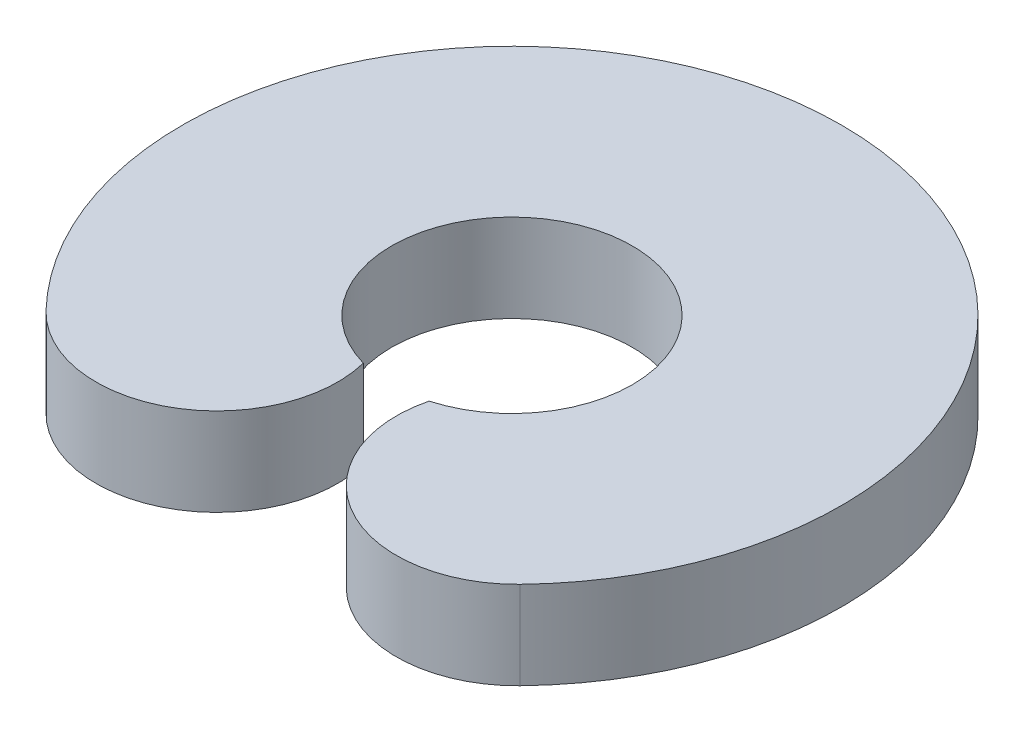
ISO-10303-21;
HEADER;
FILE_DESCRIPTION(('STEP AP214'),'2;1');
FILE_NAME('part.step','',(''),(''),'','','');
FILE_SCHEMA(('AUTOMOTIVE_DESIGN { 1 0 10303 214 1 1 1 1 }'));
ENDSEC;
DATA;
#1=APPLICATION_CONTEXT('core data for automotive mechanical design processes');
#2=APPLICATION_PROTOCOL_DEFINITION('international standard','automotive_design',2000,#1);
#3=PRODUCT_CONTEXT('',#1,'mechanical');
#4=PRODUCT('Part','Part','',(#3));
#5=PRODUCT_RELATED_PRODUCT_CATEGORY('part','',(#4));
#6=PRODUCT_DEFINITION_FORMATION('','',#4);
#7=PRODUCT_DEFINITION_CONTEXT('part definition',#1,'design');
#8=PRODUCT_DEFINITION('design','',#6,#7);
#9=PRODUCT_DEFINITION_SHAPE('','',#8);
#10=(LENGTH_UNIT() NAMED_UNIT(*) SI_UNIT(.MILLI.,.METRE.));
#11=(NAMED_UNIT(*) PLANE_ANGLE_UNIT() SI_UNIT($,.RADIAN.));
#12=(NAMED_UNIT(*) SI_UNIT($,.STERADIAN.) SOLID_ANGLE_UNIT());
#13=UNCERTAINTY_MEASURE_WITH_UNIT(LENGTH_MEASURE(1.E-05),#10,'distance_accuracy_value','');
#14=(GEOMETRIC_REPRESENTATION_CONTEXT(3) GLOBAL_UNCERTAINTY_ASSIGNED_CONTEXT((#13)) GLOBAL_UNIT_ASSIGNED_CONTEXT((#10,
#11,#12)) REPRESENTATION_CONTEXT('',''));
#15=CARTESIAN_POINT('',(0.,0.,0.));
#16=DIRECTION('',(0.,0.,1.));
#17=DIRECTION('',(1.,0.,0.));
#18=AXIS2_PLACEMENT_3D('',#15,#16,#17);
#19=CARTESIAN_POINT('',(-341.686405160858,200.,329.962725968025));
#20=DIRECTION('',(0.,-1.,0.));
#21=DIRECTION('',(0.,0.,-1.));
#22=AXIS2_PLACEMENT_3D('',#19,#20,#21);
#23=CYLINDRICAL_SURFACE('',#22,275.);
#24=CARTESIAN_POINT('',(-341.686405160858,0.,329.962725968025));
#25=DIRECTION('',(0.,1.,0.));
#26=DIRECTION('',(0.,0.,1.));
#27=AXIS2_PLACEMENT_3D('',#24,#25,#26);
#28=CIRCLE('',#27,275.);
#29=CARTESIAN_POINT('',(-539.504850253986,0.,520.993777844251));
#30=VERTEX_POINT('',#29);
#31=CARTESIAN_POINT('',(-74.8550804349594,0.,263.434204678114));
#32=VERTEX_POINT('',#31);
#33=EDGE_CURVE('E95',#30,#32,#28,.T.);
#34=ORIENTED_EDGE('',*,*,#33,.T.);
#35=DIRECTION('',(0.,-1.,0.));
#36=VECTOR('',#35,1.);
#37=CARTESIAN_POINT('',(-74.8550804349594,200.,263.434204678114));
#38=LINE('',#37,#36);
#39=CARTESIAN_POINT('',(-74.8550804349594,200.,263.434204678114));
#40=VERTEX_POINT('',#39);
#41=EDGE_CURVE('E11',#40,#32,#38,.T.);
#42=ORIENTED_EDGE('',*,*,#41,.F.);
#43=CARTESIAN_POINT('',(-341.686405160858,200.,329.962725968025));
#44=DIRECTION('',(0.,1.,0.));
#45=DIRECTION('',(0.,0.,1.));
#46=AXIS2_PLACEMENT_3D('',#43,#44,#45);
#47=CIRCLE('',#46,275.);
#48=CARTESIAN_POINT('',(-539.504850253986,200.,520.993777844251));
#49=VERTEX_POINT('',#48);
#50=EDGE_CURVE('E83',#49,#40,#47,.T.);
#51=ORIENTED_EDGE('',*,*,#50,.F.);
#52=DIRECTION('',(0.,-1.,0.));
#53=VECTOR('',#52,1.);
#54=CARTESIAN_POINT('',(-539.504850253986,200.,520.993777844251));
#55=LINE('',#54,#53);
#56=EDGE_CURVE('E91',#49,#30,#55,.T.);
#57=ORIENTED_EDGE('',*,*,#56,.T.);
#58=EDGE_LOOP('',(#34,#42,#51,#57));
#59=FACE_BOUND('',#58,.T.);
#60=ADVANCED_FACE('F32',(#59),#23,.T.);
#61=CARTESIAN_POINT('',(0.,200.,0.));
#62=DIRECTION('',(0.,-1.,0.));
#63=DIRECTION('',(0.,0.,-1.));
#64=AXIS2_PLACEMENT_3D('',#61,#62,#63);
#65=CYLINDRICAL_SURFACE('',#64,273.862854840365);
#66=CARTESIAN_POINT('',(0.,0.,0.));
#67=DIRECTION('',(0.,-1.,0.));
#68=DIRECTION('',(0.,0.,1.));
#69=AXIS2_PLACEMENT_3D('',#66,#67,#68);
#70=CIRCLE('',#69,273.862854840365);
#71=CARTESIAN_POINT('',(74.8550804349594,0.,263.434204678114));
#72=VERTEX_POINT('',#71);
#73=EDGE_CURVE('E87',#32,#72,#70,.T.);
#74=ORIENTED_EDGE('',*,*,#73,.T.);
#75=DIRECTION('',(0.,-1.,0.));
#76=VECTOR('',#75,1.);
#77=CARTESIAN_POINT('',(74.8550804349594,200.,263.434204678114));
#78=LINE('',#77,#76);
#79=CARTESIAN_POINT('',(74.8550804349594,200.,263.434204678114));
#80=VERTEX_POINT('',#79);
#81=EDGE_CURVE('E40',#80,#72,#78,.T.);
#82=ORIENTED_EDGE('',*,*,#81,.F.);
#83=CARTESIAN_POINT('',(0.,200.,0.));
#84=DIRECTION('',(0.,-1.,0.));
#85=DIRECTION('',(0.,0.,1.));
#86=AXIS2_PLACEMENT_3D('',#83,#84,#85);
#87=CIRCLE('',#86,273.862854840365);
#88=EDGE_CURVE('E78',#40,#80,#87,.T.);
#89=ORIENTED_EDGE('',*,*,#88,.F.);
#90=ORIENTED_EDGE('',*,*,#41,.T.);
#91=EDGE_LOOP('',(#74,#82,#89,#90));
#92=FACE_BOUND('',#91,.T.);
#93=ADVANCED_FACE('F86',(#92),#65,.F.);
#94=CARTESIAN_POINT('',(341.686405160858,200.,329.962725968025));
#95=DIRECTION('',(0.,-1.,0.));
#96=DIRECTION('',(0.,0.,-1.));
#97=AXIS2_PLACEMENT_3D('',#94,#95,#96);
#98=CYLINDRICAL_SURFACE('',#97,275.);
#99=CARTESIAN_POINT('',(341.686405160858,0.,329.962725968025));
#100=DIRECTION('',(0.,1.,0.));
#101=DIRECTION('',(0.,0.,1.));
#102=AXIS2_PLACEMENT_3D('',#99,#100,#101);
#103=CIRCLE('',#102,275.);
#104=CARTESIAN_POINT('',(539.504850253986,0.,520.993777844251));
#105=VERTEX_POINT('',#104);
#106=EDGE_CURVE('E65',#72,#105,#103,.T.);
#107=ORIENTED_EDGE('',*,*,#106,.T.);
#108=DIRECTION('',(0.,-1.,0.));
#109=VECTOR('',#108,1.);
#110=CARTESIAN_POINT('',(539.504850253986,200.,520.993777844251));
#111=LINE('',#110,#109);
#112=CARTESIAN_POINT('',(539.504850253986,200.,520.993777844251));
#113=VERTEX_POINT('',#112);
#114=EDGE_CURVE('E88',#113,#105,#111,.T.);
#115=ORIENTED_EDGE('',*,*,#114,.F.);
#116=CARTESIAN_POINT('',(341.686405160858,200.,329.962725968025));
#117=DIRECTION('',(0.,1.,0.));
#118=DIRECTION('',(0.,0.,1.));
#119=AXIS2_PLACEMENT_3D('',#116,#117,#118);
#120=CIRCLE('',#119,275.);
#121=EDGE_CURVE('E81',#80,#113,#120,.T.);
#122=ORIENTED_EDGE('',*,*,#121,.F.);
#123=ORIENTED_EDGE('',*,*,#81,.T.);
#124=EDGE_LOOP('',(#107,#115,#122,#123));
#125=FACE_BOUND('',#124,.T.);
#126=ADVANCED_FACE('F89',(#125),#98,.T.);
#127=CARTESIAN_POINT('',(0.,200.,0.));
#128=DIRECTION('',(0.,-1.,0.));
#129=DIRECTION('',(0.,0.,-1.));
#130=AXIS2_PLACEMENT_3D('',#127,#128,#129);
#131=CYLINDRICAL_SURFACE('',#130,750.);
#132=CARTESIAN_POINT('',(0.,0.,0.));
#133=DIRECTION('',(0.,1.,0.));
#134=DIRECTION('',(0.,0.,1.));
#135=AXIS2_PLACEMENT_3D('',#132,#133,#134);
#136=CIRCLE('',#135,750.);
#137=EDGE_CURVE('E71',#105,#30,#136,.T.);
#138=ORIENTED_EDGE('',*,*,#137,.T.);
#139=ORIENTED_EDGE('',*,*,#56,.F.);
#140=CARTESIAN_POINT('',(0.,200.,0.));
#141=DIRECTION('',(0.,1.,0.));
#142=DIRECTION('',(0.,0.,1.));
#143=AXIS2_PLACEMENT_3D('',#140,#141,#142);
#144=CIRCLE('',#143,750.);
#145=EDGE_CURVE('E48',#113,#49,#144,.T.);
#146=ORIENTED_EDGE('',*,*,#145,.F.);
#147=ORIENTED_EDGE('',*,*,#114,.T.);
#148=EDGE_LOOP('',(#138,#139,#146,#147));
#149=FACE_BOUND('',#148,.T.);
#150=ADVANCED_FACE('F102',(#149),#131,.T.);
#151=CARTESIAN_POINT('',(-170.843202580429,200.,164.981362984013));
#152=DIRECTION('',(0.,1.,0.));
#153=DIRECTION('',(0.,0.,1.));
#154=AXIS2_PLACEMENT_3D('',#151,#152,#153);
#155=PLANE('',#154);
#156=ORIENTED_EDGE('',*,*,#50,.T.);
#157=ORIENTED_EDGE('',*,*,#88,.T.);
#158=ORIENTED_EDGE('',*,*,#121,.T.);
#159=ORIENTED_EDGE('',*,*,#145,.T.);
#160=EDGE_LOOP('',(#156,#157,#158,#159));
#161=FACE_BOUND('',#160,.T.);
#162=ADVANCED_FACE('F79',(#161),#155,.T.);
#163=CARTESIAN_POINT('',(-170.843202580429,0.,164.981362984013));
#164=DIRECTION('',(0.,1.,0.));
#165=DIRECTION('',(0.,0.,1.));
#166=AXIS2_PLACEMENT_3D('',#163,#164,#165);
#167=PLANE('',#166);
#168=ORIENTED_EDGE('',*,*,#33,.F.);
#169=ORIENTED_EDGE('',*,*,#137,.F.);
#170=ORIENTED_EDGE('',*,*,#106,.F.);
#171=ORIENTED_EDGE('',*,*,#73,.F.);
#172=EDGE_LOOP('',(#168,#169,#170,#171));
#173=FACE_BOUND('',#172,.T.);
#174=ADVANCED_FACE('F105',(#173),#167,.F.);
#175=CLOSED_SHELL('',(#60,#93,#126,#150,#162,#174));
#176=MANIFOLD_SOLID_BREP('B2',#175);
#177=ADVANCED_BREP_SHAPE_REPRESENTATION('',(#18,#176),#14);
#178=SHAPE_DEFINITION_REPRESENTATION(#9,#177);
ENDSEC;
END-ISO-10303-21;
